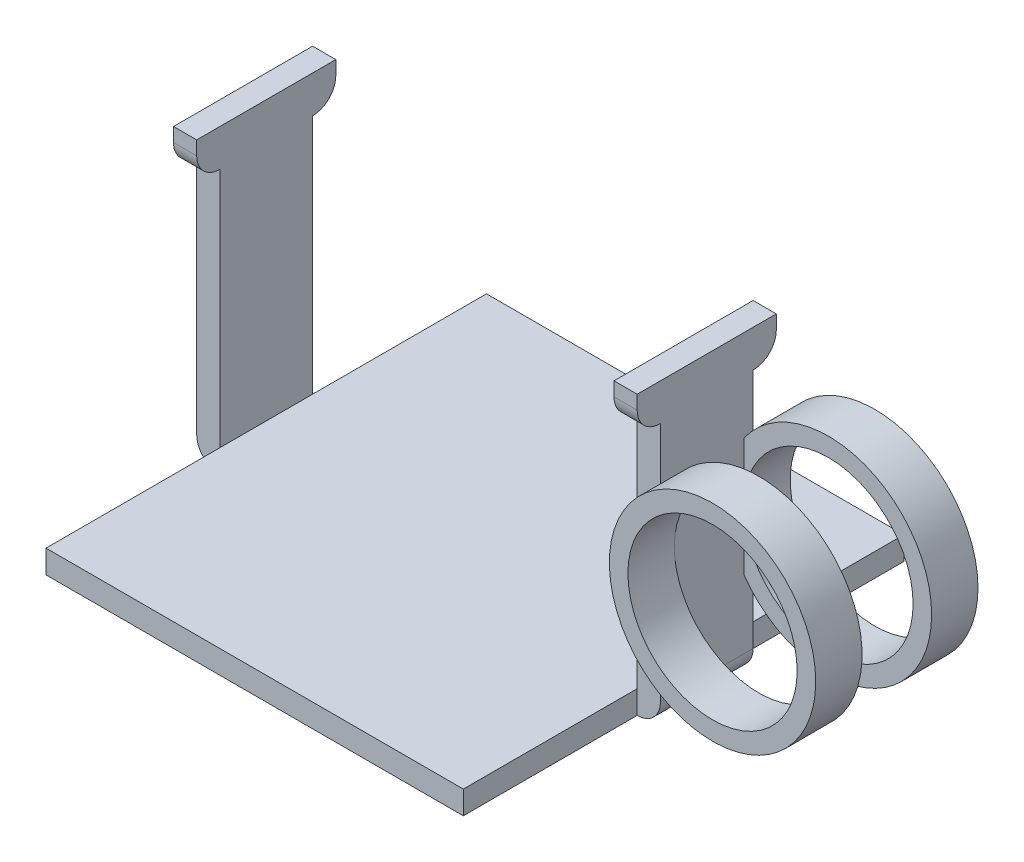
ISO-10303-21;
HEADER;
FILE_DESCRIPTION(('STEP AP214'),'2;1');
FILE_NAME('part.step','',(''),(''),'','','');
FILE_SCHEMA(('AUTOMOTIVE_DESIGN { 1 0 10303 214 1 1 1 1 }'));
ENDSEC;
DATA;
#1=APPLICATION_CONTEXT('core data for automotive mechanical design processes');
#2=APPLICATION_PROTOCOL_DEFINITION('international standard','automotive_design',2000,#1);
#3=PRODUCT_CONTEXT('',#1,'mechanical');
#4=PRODUCT('Part','Part','',(#3));
#5=PRODUCT_RELATED_PRODUCT_CATEGORY('part','',(#4));
#6=PRODUCT_DEFINITION_FORMATION('','',#4);
#7=PRODUCT_DEFINITION_CONTEXT('part definition',#1,'design');
#8=PRODUCT_DEFINITION('design','',#6,#7);
#9=PRODUCT_DEFINITION_SHAPE('','',#8);
#10=(LENGTH_UNIT() NAMED_UNIT(*) SI_UNIT(.MILLI.,.METRE.));
#11=(NAMED_UNIT(*) PLANE_ANGLE_UNIT() SI_UNIT($,.RADIAN.));
#12=(NAMED_UNIT(*) SI_UNIT($,.STERADIAN.) SOLID_ANGLE_UNIT());
#13=UNCERTAINTY_MEASURE_WITH_UNIT(LENGTH_MEASURE(1.E-05),#10,'distance_accuracy_value','');
#14=(GEOMETRIC_REPRESENTATION_CONTEXT(3) GLOBAL_UNCERTAINTY_ASSIGNED_CONTEXT((#13)) GLOBAL_UNIT_ASSIGNED_CONTEXT((#10,
#11,#12)) REPRESENTATION_CONTEXT('',''));
#15=CARTESIAN_POINT('',(0.,0.,0.));
#16=DIRECTION('',(0.,0.,1.));
#17=DIRECTION('',(1.,0.,0.));
#18=AXIS2_PLACEMENT_3D('',#15,#16,#17);
#19=CARTESIAN_POINT('',(50.,57.,0.));
#20=DIRECTION('',(1.,0.,0.));
#21=DIRECTION('',(0.,0.,-1.));
#22=AXIS2_PLACEMENT_3D('',#19,#20,#21);
#23=PLANE('',#22);
#24=DIRECTION('',(0.,0.,1.));
#25=VECTOR('',#24,1.);
#26=CARTESIAN_POINT('',(50.,45.2769235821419,-18.));
#27=LINE('',#26,#25);
#28=CARTESIAN_POINT('',(50.,45.2769235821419,-10.));
#29=VERTEX_POINT('',#28);
#30=CARTESIAN_POINT('',(50.,45.2769235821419,-8.));
#31=VERTEX_POINT('',#30);
#32=EDGE_CURVE('E259',#29,#31,#27,.T.);
#33=ORIENTED_EDGE('',*,*,#32,.F.);
#34=DIRECTION('',(0.,-1.,0.));
#35=VECTOR('',#34,1.);
#36=CARTESIAN_POINT('',(50.,57.,-10.));
#37=LINE('',#36,#35);
#38=CARTESIAN_POINT('',(50.,57.,-10.));
#39=VERTEX_POINT('',#38);
#40=EDGE_CURVE('E386',#39,#29,#37,.T.);
#41=ORIENTED_EDGE('',*,*,#40,.F.);
#42=CARTESIAN_POINT('',(50.,62.,-10.));
#43=DIRECTION('',(1.,0.,0.));
#44=DIRECTION('',(0.,0.,-1.));
#45=AXIS2_PLACEMENT_3D('',#42,#43,#44);
#46=CIRCLE('',#45,5.);
#47=CARTESIAN_POINT('',(50.,62.,-15.));
#48=VERTEX_POINT('',#47);
#49=EDGE_CURVE('E456',#39,#48,#46,.T.);
#50=ORIENTED_EDGE('',*,*,#49,.T.);
#51=DIRECTION('',(0.,-1.,0.));
#52=VECTOR('',#51,1.);
#53=CARTESIAN_POINT('',(50.,65.,-15.));
#54=LINE('',#53,#52);
#55=CARTESIAN_POINT('',(50.,65.,-15.));
#56=VERTEX_POINT('',#55);
#57=EDGE_CURVE('E363',#56,#48,#54,.T.);
#58=ORIENTED_EDGE('',*,*,#57,.F.);
#59=DIRECTION('',(0.,0.,-1.));
#60=VECTOR('',#59,1.);
#61=CARTESIAN_POINT('',(50.,65.,15.));
#62=LINE('',#61,#60);
#63=CARTESIAN_POINT('',(50.,65.,15.));
#64=VERTEX_POINT('',#63);
#65=EDGE_CURVE('E337',#64,#56,#62,.T.);
#66=ORIENTED_EDGE('',*,*,#65,.F.);
#67=DIRECTION('',(0.,-1.,0.));
#68=VECTOR('',#67,1.);
#69=CARTESIAN_POINT('',(50.,65.,15.));
#70=LINE('',#69,#68);
#71=CARTESIAN_POINT('',(50.,62.,15.));
#72=VERTEX_POINT('',#71);
#73=EDGE_CURVE('E351',#64,#72,#70,.T.);
#74=ORIENTED_EDGE('',*,*,#73,.T.);
#75=CARTESIAN_POINT('',(50.,62.,9.99999999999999));
#76=DIRECTION('',(1.,0.,0.));
#77=DIRECTION('',(0.,0.,-1.));
#78=AXIS2_PLACEMENT_3D('',#75,#76,#77);
#79=CIRCLE('',#78,5.);
#80=CARTESIAN_POINT('',(50.,57.,9.99999999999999));
#81=VERTEX_POINT('',#80);
#82=EDGE_CURVE('E459',#72,#81,#79,.T.);
#83=ORIENTED_EDGE('',*,*,#82,.T.);
#84=DIRECTION('',(0.,-1.,0.));
#85=VECTOR('',#84,1.);
#86=CARTESIAN_POINT('',(50.,57.,9.99999999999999));
#87=LINE('',#86,#85);
#88=CARTESIAN_POINT('',(50.,45.2769235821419,9.99999999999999));
#89=VERTEX_POINT('',#88);
#90=EDGE_CURVE('E391',#81,#89,#87,.T.);
#91=ORIENTED_EDGE('',*,*,#90,.T.);
#92=DIRECTION('',(0.,0.,-1.));
#93=VECTOR('',#92,1.);
#94=CARTESIAN_POINT('',(50.,45.2769235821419,17.));
#95=LINE('',#94,#93);
#96=CARTESIAN_POINT('',(50.,45.2769235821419,7.));
#97=VERTEX_POINT('',#96);
#98=EDGE_CURVE('E523',#89,#97,#95,.T.);
#99=ORIENTED_EDGE('',*,*,#98,.T.);
#100=DIRECTION('',(0.,-1.,0.));
#101=VECTOR('',#100,1.);
#102=CARTESIAN_POINT('',(50.,57.,7.));
#103=LINE('',#102,#101);
#104=CARTESIAN_POINT('',(50.,32.549001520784,7.));
#105=VERTEX_POINT('',#104);
#106=EDGE_CURVE('E519',#97,#105,#103,.T.);
#107=ORIENTED_EDGE('',*,*,#106,.T.);
#108=CARTESIAN_POINT('',(50.,19.8210794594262,7.));
#109=VERTEX_POINT('',#108);
#110=EDGE_CURVE('E514',#105,#109,#103,.T.);
#111=ORIENTED_EDGE('',*,*,#110,.T.);
#112=DIRECTION('',(0.,0.,-1.));
#113=VECTOR('',#112,1.);
#114=CARTESIAN_POINT('',(50.,19.8210794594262,17.));
#115=LINE('',#114,#113);
#116=CARTESIAN_POINT('',(50.,19.8210794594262,9.99999999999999));
#117=VERTEX_POINT('',#116);
#118=EDGE_CURVE('E518',#109,#117,#115,.F.);
#119=ORIENTED_EDGE('',*,*,#118,.T.);
#120=CARTESIAN_POINT('',(50.,5.00000000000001,9.99999999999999));
#121=VERTEX_POINT('',#120);
#122=EDGE_CURVE('E390',#117,#121,#87,.T.);
#123=ORIENTED_EDGE('',*,*,#122,.T.);
#124=DIRECTION('',(0.,0.,1.));
#125=VECTOR('',#124,1.);
#126=CARTESIAN_POINT('',(50.,5.,-10.));
#127=LINE('',#126,#125);
#128=CARTESIAN_POINT('',(50.,5.00000000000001,-10.));
#129=VERTEX_POINT('',#128);
#130=EDGE_CURVE('E452',#121,#129,#127,.F.);
#131=ORIENTED_EDGE('',*,*,#130,.T.);
#132=CARTESIAN_POINT('',(50.,19.8210794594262,-10.));
#133=VERTEX_POINT('',#132);
#134=EDGE_CURVE('E384',#133,#129,#37,.T.);
#135=ORIENTED_EDGE('',*,*,#134,.F.);
#136=DIRECTION('',(0.,0.,1.));
#137=VECTOR('',#136,1.);
#138=CARTESIAN_POINT('',(50.,19.8210794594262,-18.));
#139=LINE('',#138,#137);
#140=CARTESIAN_POINT('',(50.,19.8210794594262,-8.));
#141=VERTEX_POINT('',#140);
#142=EDGE_CURVE('E69',#141,#133,#139,.F.);
#143=ORIENTED_EDGE('',*,*,#142,.F.);
#144=DIRECTION('',(0.,-1.,0.));
#145=VECTOR('',#144,1.);
#146=CARTESIAN_POINT('',(50.,57.,-8.));
#147=LINE('',#146,#145);
#148=CARTESIAN_POINT('',(50.,32.549001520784,-8.));
#149=VERTEX_POINT('',#148);
#150=EDGE_CURVE('E57',#149,#141,#147,.T.);
#151=ORIENTED_EDGE('',*,*,#150,.F.);
#152=EDGE_CURVE('E12',#31,#149,#147,.T.);
#153=ORIENTED_EDGE('',*,*,#152,.F.);
#154=EDGE_LOOP('',(#33,#41,#50,#58,#66,#74,#83,#91,#99,#107,#111,#119,#123,#131,#135,#143,#151,#153));
#155=FACE_BOUND('',#154,.T.);
#156=ADVANCED_FACE('F53',(#155),#23,.T.);
#157=CARTESIAN_POINT('',(-45.,5.,0.));
#158=DIRECTION('',(-1.,0.,0.));
#159=DIRECTION('',(0.,0.,1.));
#160=AXIS2_PLACEMENT_3D('',#157,#158,#159);
#161=PLANE('',#160);
#162=DIRECTION('',(0.,0.,-1.));
#163=VECTOR('',#162,1.);
#164=CARTESIAN_POINT('',(-45.,5.,0.));
#165=LINE('',#164,#163);
#166=CARTESIAN_POINT('',(-45.,5.,47.5));
#167=VERTEX_POINT('',#166);
#168=CARTESIAN_POINT('',(-45.,5.00000000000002,9.99999999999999));
#169=VERTEX_POINT('',#168);
#170=EDGE_CURVE('E412',#167,#169,#165,.T.);
#171=ORIENTED_EDGE('',*,*,#170,.T.);
#172=DIRECTION('',(0.,-1.,0.));
#173=VECTOR('',#172,1.);
#174=CARTESIAN_POINT('',(-45.,57.,9.99999999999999));
#175=LINE('',#174,#173);
#176=CARTESIAN_POINT('',(-45.,0.,9.99999999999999));
#177=VERTEX_POINT('',#176);
#178=EDGE_CURVE('E338',#169,#177,#175,.T.);
#179=ORIENTED_EDGE('',*,*,#178,.T.);
#180=DIRECTION('',(0.,0.,-1.));
#181=VECTOR('',#180,1.);
#182=CARTESIAN_POINT('',(-45.,0.,0.));
#183=LINE('',#182,#181);
#184=CARTESIAN_POINT('',(-45.,0.,47.5));
#185=VERTEX_POINT('',#184);
#186=EDGE_CURVE('E401',#185,#177,#183,.T.);
#187=ORIENTED_EDGE('',*,*,#186,.F.);
#188=DIRECTION('',(0.,-1.,0.));
#189=VECTOR('',#188,1.);
#190=CARTESIAN_POINT('',(-45.,5.,47.5));
#191=LINE('',#190,#189);
#192=EDGE_CURVE('E416',#167,#185,#191,.T.);
#193=ORIENTED_EDGE('',*,*,#192,.F.);
#194=EDGE_LOOP('',(#171,#179,#187,#193));
#195=FACE_BOUND('',#194,.T.);
#196=ADVANCED_FACE('F553',(#195),#161,.T.);
#197=CARTESIAN_POINT('',(45.,5.,0.));
#198=DIRECTION('',(-1.,0.,0.));
#199=DIRECTION('',(0.,0.,1.));
#200=AXIS2_PLACEMENT_3D('',#197,#198,#199);
#201=PLANE('',#200);
#202=DIRECTION('',(0.,-1.,0.));
#203=VECTOR('',#202,1.);
#204=CARTESIAN_POINT('',(45.,57.,9.99999999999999));
#205=LINE('',#204,#203);
#206=CARTESIAN_POINT('',(45.,5.00000000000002,9.99999999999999));
#207=VERTEX_POINT('',#206);
#208=CARTESIAN_POINT('',(45.,0.,9.99999999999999));
#209=VERTEX_POINT('',#208);
#210=EDGE_CURVE('E380',#207,#209,#205,.T.);
#211=ORIENTED_EDGE('',*,*,#210,.F.);
#212=DIRECTION('',(0.,0.,-1.));
#213=VECTOR('',#212,1.);
#214=CARTESIAN_POINT('',(45.,5.,0.));
#215=LINE('',#214,#213);
#216=CARTESIAN_POINT('',(45.,5.,47.5));
#217=VERTEX_POINT('',#216);
#218=EDGE_CURVE('E402',#217,#207,#215,.T.);
#219=ORIENTED_EDGE('',*,*,#218,.F.);
#220=DIRECTION('',(0.,-1.,0.));
#221=VECTOR('',#220,1.);
#222=CARTESIAN_POINT('',(45.,5.,47.5));
#223=LINE('',#222,#221);
#224=CARTESIAN_POINT('',(45.,0.,47.5));
#225=VERTEX_POINT('',#224);
#226=EDGE_CURVE('E444',#217,#225,#223,.T.);
#227=ORIENTED_EDGE('',*,*,#226,.T.);
#228=DIRECTION('',(0.,0.,-1.));
#229=VECTOR('',#228,1.);
#230=CARTESIAN_POINT('',(45.,0.,0.));
#231=LINE('',#230,#229);
#232=EDGE_CURVE('E422',#225,#209,#231,.T.);
#233=ORIENTED_EDGE('',*,*,#232,.T.);
#234=EDGE_LOOP('',(#211,#219,#227,#233));
#235=FACE_BOUND('',#234,.T.);
#236=ADVANCED_FACE('F558',(#235),#201,.F.);
#237=CARTESIAN_POINT('',(0.,5.,47.5));
#238=DIRECTION('',(0.,0.,-1.));
#239=DIRECTION('',(-1.,0.,0.));
#240=AXIS2_PLACEMENT_3D('',#237,#238,#239);
#241=PLANE('',#240);
#242=DIRECTION('',(1.,0.,0.));
#243=VECTOR('',#242,1.);
#244=CARTESIAN_POINT('',(0.,0.,47.5));
#245=LINE('',#244,#243);
#246=EDGE_CURVE('E395',#185,#225,#245,.T.);
#247=ORIENTED_EDGE('',*,*,#246,.T.);
#248=ORIENTED_EDGE('',*,*,#226,.F.);
#249=DIRECTION('',(1.,0.,0.));
#250=VECTOR('',#249,1.);
#251=CARTESIAN_POINT('',(0.,5.,47.5));
#252=LINE('',#251,#250);
#253=EDGE_CURVE('E396',#167,#217,#252,.T.);
#254=ORIENTED_EDGE('',*,*,#253,.F.);
#255=ORIENTED_EDGE('',*,*,#192,.T.);
#256=EDGE_LOOP('',(#247,#248,#254,#255));
#257=FACE_BOUND('',#256,.T.);
#258=ADVANCED_FACE('F588',(#257),#241,.F.);
#259=CARTESIAN_POINT('',(45.,5.00000000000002,-10.));
#260=VERTEX_POINT('',#259);
#261=CARTESIAN_POINT('',(45.,5.,-47.5));
#262=VERTEX_POINT('',#261);
#263=EDGE_CURVE('E400',#260,#262,#215,.T.);
#264=ORIENTED_EDGE('',*,*,#263,.F.);
#265=DIRECTION('',(0.,-1.,0.));
#266=VECTOR('',#265,1.);
#267=CARTESIAN_POINT('',(45.,57.,-10.));
#268=LINE('',#267,#266);
#269=CARTESIAN_POINT('',(45.,0.,-10.));
#270=VERTEX_POINT('',#269);
#271=EDGE_CURVE('E385',#260,#270,#268,.T.);
#272=ORIENTED_EDGE('',*,*,#271,.T.);
#273=CARTESIAN_POINT('',(45.,0.,-47.5));
#274=VERTEX_POINT('',#273);
#275=EDGE_CURVE('E421',#270,#274,#231,.T.);
#276=ORIENTED_EDGE('',*,*,#275,.T.);
#277=DIRECTION('',(0.,-1.,0.));
#278=VECTOR('',#277,1.);
#279=CARTESIAN_POINT('',(45.,5.,-47.5));
#280=LINE('',#279,#278);
#281=EDGE_CURVE('E440',#262,#274,#280,.T.);
#282=ORIENTED_EDGE('',*,*,#281,.F.);
#283=EDGE_LOOP('',(#264,#272,#276,#282));
#284=FACE_BOUND('',#283,.T.);
#285=ADVANCED_FACE('F584',(#284),#201,.F.);
#286=CARTESIAN_POINT('',(0.,5.,-47.5));
#287=DIRECTION('',(0.,0.,-1.));
#288=DIRECTION('',(-1.,0.,0.));
#289=AXIS2_PLACEMENT_3D('',#286,#287,#288);
#290=PLANE('',#289);
#291=DIRECTION('',(1.,0.,0.));
#292=VECTOR('',#291,1.);
#293=CARTESIAN_POINT('',(0.,0.,-47.5));
#294=LINE('',#293,#292);
#295=CARTESIAN_POINT('',(-45.,0.,-47.5));
#296=VERTEX_POINT('',#295);
#297=EDGE_CURVE('E426',#296,#274,#294,.T.);
#298=ORIENTED_EDGE('',*,*,#297,.F.);
#299=DIRECTION('',(0.,-1.,0.));
#300=VECTOR('',#299,1.);
#301=CARTESIAN_POINT('',(-45.,5.,-47.5));
#302=LINE('',#301,#300);
#303=CARTESIAN_POINT('',(-45.,5.,-47.5));
#304=VERTEX_POINT('',#303);
#305=EDGE_CURVE('E436',#304,#296,#302,.T.);
#306=ORIENTED_EDGE('',*,*,#305,.F.);
#307=DIRECTION('',(1.,0.,0.));
#308=VECTOR('',#307,1.);
#309=CARTESIAN_POINT('',(0.,5.,-47.5));
#310=LINE('',#309,#308);
#311=EDGE_CURVE('E406',#304,#262,#310,.T.);
#312=ORIENTED_EDGE('',*,*,#311,.T.);
#313=ORIENTED_EDGE('',*,*,#281,.T.);
#314=EDGE_LOOP('',(#298,#306,#312,#313));
#315=FACE_BOUND('',#314,.T.);
#316=ADVANCED_FACE('F580',(#315),#290,.T.);
#317=DIRECTION('',(0.,-1.,0.));
#318=VECTOR('',#317,1.);
#319=CARTESIAN_POINT('',(-45.,57.,-10.));
#320=LINE('',#319,#318);
#321=CARTESIAN_POINT('',(-45.,5.00000000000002,-10.));
#322=VERTEX_POINT('',#321);
#323=CARTESIAN_POINT('',(-45.,0.,-10.));
#324=VERTEX_POINT('',#323);
#325=EDGE_CURVE('E333',#322,#324,#320,.T.);
#326=ORIENTED_EDGE('',*,*,#325,.F.);
#327=EDGE_CURVE('E411',#322,#304,#165,.T.);
#328=ORIENTED_EDGE('',*,*,#327,.T.);
#329=ORIENTED_EDGE('',*,*,#305,.T.);
#330=EDGE_CURVE('E430',#324,#296,#183,.T.);
#331=ORIENTED_EDGE('',*,*,#330,.F.);
#332=EDGE_LOOP('',(#326,#328,#329,#331));
#333=FACE_BOUND('',#332,.T.);
#334=ADVANCED_FACE('F561',(#333),#161,.T.);
#335=CARTESIAN_POINT('',(0.,5.,0.));
#336=DIRECTION('',(0.,1.,0.));
#337=DIRECTION('',(0.,0.,1.));
#338=AXIS2_PLACEMENT_3D('',#335,#336,#337);
#339=PLANE('',#338);
#340=ORIENTED_EDGE('',*,*,#253,.T.);
#341=ORIENTED_EDGE('',*,*,#218,.T.);
#342=EDGE_CURVE('E407',#207,#260,#215,.T.);
#343=ORIENTED_EDGE('',*,*,#342,.T.);
#344=ORIENTED_EDGE('',*,*,#263,.T.);
#345=ORIENTED_EDGE('',*,*,#311,.F.);
#346=ORIENTED_EDGE('',*,*,#327,.F.);
#347=EDGE_CURVE('E417',#169,#322,#165,.T.);
#348=ORIENTED_EDGE('',*,*,#347,.F.);
#349=ORIENTED_EDGE('',*,*,#170,.F.);
#350=EDGE_LOOP('',(#340,#341,#343,#344,#345,#346,#348,#349));
#351=FACE_BOUND('',#350,.T.);
#352=ADVANCED_FACE('F571',(#351),#339,.T.);
#353=CARTESIAN_POINT('',(0.,0.,0.));
#354=DIRECTION('',(0.,1.,0.));
#355=DIRECTION('',(0.,0.,1.));
#356=AXIS2_PLACEMENT_3D('',#353,#354,#355);
#357=PLANE('',#356);
#358=ORIENTED_EDGE('',*,*,#186,.T.);
#359=DIRECTION('',(0.,0.,1.));
#360=VECTOR('',#359,1.);
#361=CARTESIAN_POINT('',(-45.,0.,0.));
#362=LINE('',#361,#360);
#363=EDGE_CURVE('E508',#177,#324,#362,.F.);
#364=ORIENTED_EDGE('',*,*,#363,.T.);
#365=ORIENTED_EDGE('',*,*,#330,.T.);
#366=ORIENTED_EDGE('',*,*,#297,.T.);
#367=ORIENTED_EDGE('',*,*,#275,.F.);
#368=DIRECTION('',(0.,0.,1.));
#369=VECTOR('',#368,1.);
#370=CARTESIAN_POINT('',(45.,0.,9.99999999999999));
#371=LINE('',#370,#369);
#372=EDGE_CURVE('E472',#270,#209,#371,.T.);
#373=ORIENTED_EDGE('',*,*,#372,.T.);
#374=ORIENTED_EDGE('',*,*,#232,.F.);
#375=ORIENTED_EDGE('',*,*,#246,.F.);
#376=EDGE_LOOP('',(#358,#364,#365,#366,#367,#373,#374,#375));
#377=FACE_BOUND('',#376,.T.);
#378=ADVANCED_FACE('F574',(#377),#357,.F.);
#379=CARTESIAN_POINT('',(45.,57.,0.));
#380=DIRECTION('',(-1.,0.,0.));
#381=DIRECTION('',(0.,0.,1.));
#382=AXIS2_PLACEMENT_3D('',#379,#380,#381);
#383=PLANE('',#382);
#384=CARTESIAN_POINT('',(45.,57.,9.99999999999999));
#385=VERTEX_POINT('',#384);
#386=EDGE_CURVE('E375',#385,#207,#205,.T.);
#387=ORIENTED_EDGE('',*,*,#386,.F.);
#388=CARTESIAN_POINT('',(45.,62.,9.99999999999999));
#389=DIRECTION('',(-1.,0.,0.));
#390=DIRECTION('',(0.,0.,1.));
#391=AXIS2_PLACEMENT_3D('',#388,#389,#390);
#392=CIRCLE('',#391,5.);
#393=CARTESIAN_POINT('',(45.,62.,15.));
#394=VERTEX_POINT('',#393);
#395=EDGE_CURVE('E465',#385,#394,#392,.T.);
#396=ORIENTED_EDGE('',*,*,#395,.T.);
#397=DIRECTION('',(0.,-1.,0.));
#398=VECTOR('',#397,1.);
#399=CARTESIAN_POINT('',(45.,65.,15.));
#400=LINE('',#399,#398);
#401=CARTESIAN_POINT('',(45.,65.,15.));
#402=VERTEX_POINT('',#401);
#403=EDGE_CURVE('E355',#402,#394,#400,.T.);
#404=ORIENTED_EDGE('',*,*,#403,.F.);
#405=DIRECTION('',(0.,0.,1.));
#406=VECTOR('',#405,1.);
#407=CARTESIAN_POINT('',(45.,65.,15.));
#408=LINE('',#407,#406);
#409=CARTESIAN_POINT('',(45.,65.,-15.));
#410=VERTEX_POINT('',#409);
#411=EDGE_CURVE('E345',#410,#402,#408,.T.);
#412=ORIENTED_EDGE('',*,*,#411,.F.);
#413=DIRECTION('',(0.,-1.,0.));
#414=VECTOR('',#413,1.);
#415=CARTESIAN_POINT('',(45.,65.,-15.));
#416=LINE('',#415,#414);
#417=CARTESIAN_POINT('',(45.,62.,-15.));
#418=VERTEX_POINT('',#417);
#419=EDGE_CURVE('E359',#410,#418,#416,.T.);
#420=ORIENTED_EDGE('',*,*,#419,.T.);
#421=CARTESIAN_POINT('',(45.,62.,-10.));
#422=DIRECTION('',(-1.,0.,0.));
#423=DIRECTION('',(0.,0.,1.));
#424=AXIS2_PLACEMENT_3D('',#421,#422,#423);
#425=CIRCLE('',#424,5.);
#426=CARTESIAN_POINT('',(45.,57.,-10.));
#427=VERTEX_POINT('',#426);
#428=EDGE_CURVE('E462',#418,#427,#425,.T.);
#429=ORIENTED_EDGE('',*,*,#428,.T.);
#430=EDGE_CURVE('E379',#427,#260,#268,.T.);
#431=ORIENTED_EDGE('',*,*,#430,.T.);
#432=ORIENTED_EDGE('',*,*,#342,.F.);
#433=EDGE_LOOP('',(#387,#396,#404,#412,#420,#429,#431,#432));
#434=FACE_BOUND('',#433,.T.);
#435=ADVANCED_FACE('F569',(#434),#383,.T.);
#436=CARTESIAN_POINT('',(0.,57.,10.));
#437=DIRECTION('',(0.,0.,1.));
#438=DIRECTION('',(1.,0.,0.));
#439=AXIS2_PLACEMENT_3D('',#436,#437,#438);
#440=PLANE('',#439);
#441=ORIENTED_EDGE('',*,*,#122,.F.);
#442=CARTESIAN_POINT('',(68.25,32.549001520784,9.99999999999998));
#443=DIRECTION('',(0.,0.,1.));
#444=DIRECTION('',(1.,0.,0.));
#445=AXIS2_PLACEMENT_3D('',#442,#443,#444);
#446=CIRCLE('',#445,22.25);
#447=EDGE_CURVE('E274',#117,#89,#446,.F.);
#448=ORIENTED_EDGE('',*,*,#447,.T.);
#449=ORIENTED_EDGE('',*,*,#90,.F.);
#450=DIRECTION('',(-1.,0.,0.));
#451=VECTOR('',#450,1.);
#452=CARTESIAN_POINT('',(0.,57.,10.));
#453=LINE('',#452,#451);
#454=EDGE_CURVE('E367',#81,#385,#453,.T.);
#455=ORIENTED_EDGE('',*,*,#454,.T.);
#456=ORIENTED_EDGE('',*,*,#386,.T.);
#457=ORIENTED_EDGE('',*,*,#210,.T.);
#458=CARTESIAN_POINT('',(45.,5.,9.99999999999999));
#459=DIRECTION('',(0.,0.,1.));
#460=DIRECTION('',(1.,0.,0.));
#461=AXIS2_PLACEMENT_3D('',#458,#459,#460);
#462=CIRCLE('',#461,5.);
#463=EDGE_CURVE('E476',#209,#121,#462,.T.);
#464=ORIENTED_EDGE('',*,*,#463,.T.);
#465=EDGE_LOOP('',(#441,#448,#449,#455,#456,#457,#464));
#466=FACE_BOUND('',#465,.T.);
#467=ADVANCED_FACE('F566',(#466),#440,.T.);
#468=CARTESIAN_POINT('',(0.,57.,-9.99999999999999));
#469=DIRECTION('',(0.,0.,1.));
#470=DIRECTION('',(1.,0.,0.));
#471=AXIS2_PLACEMENT_3D('',#468,#469,#470);
#472=PLANE('',#471);
#473=ORIENTED_EDGE('',*,*,#40,.T.);
#474=CARTESIAN_POINT('',(68.25,32.549001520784,-10.));
#475=DIRECTION('',(0.,0.,1.));
#476=DIRECTION('',(1.,0.,0.));
#477=AXIS2_PLACEMENT_3D('',#474,#475,#476);
#478=CIRCLE('',#477,22.25);
#479=EDGE_CURVE('E526',#29,#133,#478,.T.);
#480=ORIENTED_EDGE('',*,*,#479,.T.);
#481=ORIENTED_EDGE('',*,*,#134,.T.);
#482=CARTESIAN_POINT('',(45.,5.,-10.));
#483=DIRECTION('',(0.,0.,1.));
#484=DIRECTION('',(1.,0.,0.));
#485=AXIS2_PLACEMENT_3D('',#482,#483,#484);
#486=CIRCLE('',#485,5.);
#487=EDGE_CURVE('E480',#129,#270,#486,.F.);
#488=ORIENTED_EDGE('',*,*,#487,.T.);
#489=ORIENTED_EDGE('',*,*,#271,.F.);
#490=ORIENTED_EDGE('',*,*,#430,.F.);
#491=DIRECTION('',(-1.,0.,0.));
#492=VECTOR('',#491,1.);
#493=CARTESIAN_POINT('',(0.,57.,-9.99999999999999));
#494=LINE('',#493,#492);
#495=EDGE_CURVE('E371',#39,#427,#494,.T.);
#496=ORIENTED_EDGE('',*,*,#495,.F.);
#497=EDGE_LOOP('',(#473,#480,#481,#488,#489,#490,#496));
#498=FACE_BOUND('',#497,.T.);
#499=ADVANCED_FACE('F564',(#498),#472,.F.);
#500=CARTESIAN_POINT('',(45.,65.,-15.));
#501=DIRECTION('',(0.,0.,1.));
#502=DIRECTION('',(1.,0.,0.));
#503=AXIS2_PLACEMENT_3D('',#500,#501,#502);
#504=PLANE('',#503);
#505=ORIENTED_EDGE('',*,*,#57,.T.);
#506=DIRECTION('',(-1.,0.,0.));
#507=VECTOR('',#506,1.);
#508=CARTESIAN_POINT('',(45.,62.,-15.));
#509=LINE('',#508,#507);
#510=EDGE_CURVE('E468',#48,#418,#509,.T.);
#511=ORIENTED_EDGE('',*,*,#510,.T.);
#512=ORIENTED_EDGE('',*,*,#419,.F.);
#513=DIRECTION('',(-1.,0.,0.));
#514=VECTOR('',#513,1.);
#515=CARTESIAN_POINT('',(45.,65.,-15.));
#516=LINE('',#515,#514);
#517=EDGE_CURVE('E342',#56,#410,#516,.T.);
#518=ORIENTED_EDGE('',*,*,#517,.F.);
#519=EDGE_LOOP('',(#505,#511,#512,#518));
#520=FACE_BOUND('',#519,.T.);
#521=ADVANCED_FACE('F675',(#520),#504,.F.);
#522=CARTESIAN_POINT('',(45.,65.,15.));
#523=DIRECTION('',(0.,0.,-1.));
#524=DIRECTION('',(-1.,0.,0.));
#525=AXIS2_PLACEMENT_3D('',#522,#523,#524);
#526=PLANE('',#525);
#527=ORIENTED_EDGE('',*,*,#403,.T.);
#528=DIRECTION('',(1.,0.,0.));
#529=VECTOR('',#528,1.);
#530=CARTESIAN_POINT('',(50.,62.,15.));
#531=LINE('',#530,#529);
#532=EDGE_CURVE('E448',#394,#72,#531,.T.);
#533=ORIENTED_EDGE('',*,*,#532,.T.);
#534=ORIENTED_EDGE('',*,*,#73,.F.);
#535=DIRECTION('',(1.,0.,0.));
#536=VECTOR('',#535,1.);
#537=CARTESIAN_POINT('',(45.,65.,15.));
#538=LINE('',#537,#536);
#539=EDGE_CURVE('E348',#402,#64,#538,.T.);
#540=ORIENTED_EDGE('',*,*,#539,.F.);
#541=EDGE_LOOP('',(#527,#533,#534,#540));
#542=FACE_BOUND('',#541,.T.);
#543=ADVANCED_FACE('F671',(#542),#526,.F.);
#544=CARTESIAN_POINT('',(0.,65.,0.));
#545=DIRECTION('',(0.,-1.,0.));
#546=DIRECTION('',(0.,0.,-1.));
#547=AXIS2_PLACEMENT_3D('',#544,#545,#546);
#548=PLANE('',#547);
#549=ORIENTED_EDGE('',*,*,#65,.T.);
#550=ORIENTED_EDGE('',*,*,#517,.T.);
#551=ORIENTED_EDGE('',*,*,#411,.T.);
#552=ORIENTED_EDGE('',*,*,#539,.T.);
#553=EDGE_LOOP('',(#549,#550,#551,#552));
#554=FACE_BOUND('',#553,.T.);
#555=ADVANCED_FACE('F597',(#554),#548,.F.);
#556=CARTESIAN_POINT('',(45.,62.,9.99999999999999));
#557=DIRECTION('',(-1.,0.,0.));
#558=DIRECTION('',(0.,0.,1.));
#559=AXIS2_PLACEMENT_3D('',#556,#557,#558);
#560=CYLINDRICAL_SURFACE('',#559,5.);
#561=ORIENTED_EDGE('',*,*,#395,.F.);
#562=ORIENTED_EDGE('',*,*,#454,.F.);
#563=ORIENTED_EDGE('',*,*,#82,.F.);
#564=ORIENTED_EDGE('',*,*,#532,.F.);
#565=EDGE_LOOP('',(#561,#562,#563,#564));
#566=FACE_BOUND('',#565,.T.);
#567=ADVANCED_FACE('F593',(#566),#560,.T.);
#568=CARTESIAN_POINT('',(45.,62.,-10.));
#569=DIRECTION('',(1.,0.,0.));
#570=DIRECTION('',(0.,0.,-1.));
#571=AXIS2_PLACEMENT_3D('',#568,#569,#570);
#572=CYLINDRICAL_SURFACE('',#571,5.);
#573=ORIENTED_EDGE('',*,*,#49,.F.);
#574=ORIENTED_EDGE('',*,*,#495,.T.);
#575=ORIENTED_EDGE('',*,*,#428,.F.);
#576=ORIENTED_EDGE('',*,*,#510,.F.);
#577=EDGE_LOOP('',(#573,#574,#575,#576));
#578=FACE_BOUND('',#577,.T.);
#579=ADVANCED_FACE('F596',(#578),#572,.T.);
#580=CARTESIAN_POINT('',(45.,5.,0.));
#581=DIRECTION('',(0.,0.,-1.));
#582=DIRECTION('',(-1.,0.,0.));
#583=AXIS2_PLACEMENT_3D('',#580,#581,#582);
#584=CYLINDRICAL_SURFACE('',#583,5.);
#585=ORIENTED_EDGE('',*,*,#487,.F.);
#586=ORIENTED_EDGE('',*,*,#130,.F.);
#587=ORIENTED_EDGE('',*,*,#463,.F.);
#588=ORIENTED_EDGE('',*,*,#372,.F.);
#589=EDGE_LOOP('',(#585,#586,#587,#588));
#590=FACE_BOUND('',#589,.T.);
#591=ADVANCED_FACE('F601',(#590),#584,.T.);
#592=CARTESIAN_POINT('',(-45.,57.,0.));
#593=DIRECTION('',(-1.,0.,0.));
#594=DIRECTION('',(0.,0.,1.));
#595=AXIS2_PLACEMENT_3D('',#592,#593,#594);
#596=PLANE('',#595);
#597=DIRECTION('',(0.,-1.,0.));
#598=VECTOR('',#597,1.);
#599=CARTESIAN_POINT('',(-45.,65.,15.));
#600=LINE('',#599,#598);
#601=CARTESIAN_POINT('',(-45.,65.,15.));
#602=VERTEX_POINT('',#601);
#603=CARTESIAN_POINT('',(-45.,62.,15.));
#604=VERTEX_POINT('',#603);
#605=EDGE_CURVE('E304',#602,#604,#600,.T.);
#606=ORIENTED_EDGE('',*,*,#605,.T.);
#607=CARTESIAN_POINT('',(-45.,62.,9.99999999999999));
#608=DIRECTION('',(-1.,0.,0.));
#609=DIRECTION('',(0.,0.,1.));
#610=AXIS2_PLACEMENT_3D('',#607,#608,#609);
#611=CIRCLE('',#610,5.);
#612=CARTESIAN_POINT('',(-45.,57.,9.99999999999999));
#613=VERTEX_POINT('',#612);
#614=EDGE_CURVE('E499',#604,#613,#611,.F.);
#615=ORIENTED_EDGE('',*,*,#614,.T.);
#616=EDGE_CURVE('E332',#613,#169,#175,.T.);
#617=ORIENTED_EDGE('',*,*,#616,.T.);
#618=ORIENTED_EDGE('',*,*,#347,.T.);
#619=CARTESIAN_POINT('',(-45.,57.,-10.));
#620=VERTEX_POINT('',#619);
#621=EDGE_CURVE('E328',#620,#322,#320,.T.);
#622=ORIENTED_EDGE('',*,*,#621,.F.);
#623=CARTESIAN_POINT('',(-45.,62.,-10.));
#624=DIRECTION('',(-1.,0.,0.));
#625=DIRECTION('',(0.,0.,1.));
#626=AXIS2_PLACEMENT_3D('',#623,#624,#625);
#627=CIRCLE('',#626,5.);
#628=CARTESIAN_POINT('',(-45.,62.,-15.));
#629=VERTEX_POINT('',#628);
#630=EDGE_CURVE('E496',#620,#629,#627,.F.);
#631=ORIENTED_EDGE('',*,*,#630,.T.);
#632=DIRECTION('',(0.,-1.,0.));
#633=VECTOR('',#632,1.);
#634=CARTESIAN_POINT('',(-45.,65.,-15.));
#635=LINE('',#634,#633);
#636=CARTESIAN_POINT('',(-45.,65.,-15.));
#637=VERTEX_POINT('',#636);
#638=EDGE_CURVE('E300',#637,#629,#635,.T.);
#639=ORIENTED_EDGE('',*,*,#638,.F.);
#640=DIRECTION('',(0.,0.,1.));
#641=VECTOR('',#640,1.);
#642=CARTESIAN_POINT('',(-45.,65.,15.));
#643=LINE('',#642,#641);
#644=EDGE_CURVE('E288',#637,#602,#643,.T.);
#645=ORIENTED_EDGE('',*,*,#644,.T.);
#646=EDGE_LOOP('',(#606,#615,#617,#618,#622,#631,#639,#645));
#647=FACE_BOUND('',#646,.T.);
#648=ADVANCED_FACE('F605',(#647),#596,.F.);
#649=CARTESIAN_POINT('',(0.,57.,10.));
#650=DIRECTION('',(0.,0.,-1.));
#651=DIRECTION('',(-1.,0.,0.));
#652=AXIS2_PLACEMENT_3D('',#649,#650,#651);
#653=PLANE('',#652);
#654=DIRECTION('',(0.,-1.,0.));
#655=VECTOR('',#654,1.);
#656=CARTESIAN_POINT('',(-50.,57.,9.99999999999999));
#657=LINE('',#656,#655);
#658=CARTESIAN_POINT('',(-50.,57.,9.99999999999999));
#659=VERTEX_POINT('',#658);
#660=CARTESIAN_POINT('',(-50.,5.00000000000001,9.99999999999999));
#661=VERTEX_POINT('',#660);
#662=EDGE_CURVE('E320',#659,#661,#657,.T.);
#663=ORIENTED_EDGE('',*,*,#662,.T.);
#664=CARTESIAN_POINT('',(-45.,5.,9.99999999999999));
#665=DIRECTION('',(0.,0.,-1.));
#666=DIRECTION('',(-1.,0.,0.));
#667=AXIS2_PLACEMENT_3D('',#664,#665,#666);
#668=CIRCLE('',#667,5.);
#669=EDGE_CURVE('E505',#661,#177,#668,.F.);
#670=ORIENTED_EDGE('',*,*,#669,.T.);
#671=ORIENTED_EDGE('',*,*,#178,.F.);
#672=ORIENTED_EDGE('',*,*,#616,.F.);
#673=DIRECTION('',(1.,0.,0.));
#674=VECTOR('',#673,1.);
#675=CARTESIAN_POINT('',(0.,57.,10.));
#676=LINE('',#675,#674);
#677=EDGE_CURVE('E312',#659,#613,#676,.T.);
#678=ORIENTED_EDGE('',*,*,#677,.F.);
#679=EDGE_LOOP('',(#663,#670,#671,#672,#678));
#680=FACE_BOUND('',#679,.T.);
#681=ADVANCED_FACE('F636',(#680),#653,.F.);
#682=CARTESIAN_POINT('',(0.,57.,-9.99999999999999));
#683=DIRECTION('',(0.,0.,-1.));
#684=DIRECTION('',(-1.,0.,0.));
#685=AXIS2_PLACEMENT_3D('',#682,#683,#684);
#686=PLANE('',#685);
#687=ORIENTED_EDGE('',*,*,#325,.T.);
#688=CARTESIAN_POINT('',(-45.,5.,-10.));
#689=DIRECTION('',(0.,0.,-1.));
#690=DIRECTION('',(-1.,0.,0.));
#691=AXIS2_PLACEMENT_3D('',#688,#689,#690);
#692=CIRCLE('',#691,5.);
#693=CARTESIAN_POINT('',(-50.,5.00000000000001,-10.));
#694=VERTEX_POINT('',#693);
#695=EDGE_CURVE('E511',#324,#694,#692,.T.);
#696=ORIENTED_EDGE('',*,*,#695,.T.);
#697=DIRECTION('',(0.,-1.,0.));
#698=VECTOR('',#697,1.);
#699=CARTESIAN_POINT('',(-50.,57.,-10.));
#700=LINE('',#699,#698);
#701=CARTESIAN_POINT('',(-50.,57.,-10.));
#702=VERTEX_POINT('',#701);
#703=EDGE_CURVE('E324',#702,#694,#700,.T.);
#704=ORIENTED_EDGE('',*,*,#703,.F.);
#705=DIRECTION('',(1.,0.,0.));
#706=VECTOR('',#705,1.);
#707=CARTESIAN_POINT('',(0.,57.,-9.99999999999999));
#708=LINE('',#707,#706);
#709=EDGE_CURVE('E316',#702,#620,#708,.T.);
#710=ORIENTED_EDGE('',*,*,#709,.T.);
#711=ORIENTED_EDGE('',*,*,#621,.T.);
#712=EDGE_LOOP('',(#687,#696,#704,#710,#711));
#713=FACE_BOUND('',#712,.T.);
#714=ADVANCED_FACE('F629',(#713),#686,.T.);
#715=CARTESIAN_POINT('',(-50.,57.,0.));
#716=DIRECTION('',(1.,0.,0.));
#717=DIRECTION('',(0.,0.,-1.));
#718=AXIS2_PLACEMENT_3D('',#715,#716,#717);
#719=PLANE('',#718);
#720=ORIENTED_EDGE('',*,*,#662,.F.);
#721=CARTESIAN_POINT('',(-50.,62.,9.99999999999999));
#722=DIRECTION('',(1.,0.,0.));
#723=DIRECTION('',(0.,0.,-1.));
#724=AXIS2_PLACEMENT_3D('',#721,#722,#723);
#725=CIRCLE('',#724,5.);
#726=CARTESIAN_POINT('',(-50.,62.,15.));
#727=VERTEX_POINT('',#726);
#728=EDGE_CURVE('E490',#659,#727,#725,.F.);
#729=ORIENTED_EDGE('',*,*,#728,.T.);
#730=DIRECTION('',(0.,-1.,0.));
#731=VECTOR('',#730,1.);
#732=CARTESIAN_POINT('',(-50.,65.,15.));
#733=LINE('',#732,#731);
#734=CARTESIAN_POINT('',(-50.,65.,15.));
#735=VERTEX_POINT('',#734);
#736=EDGE_CURVE('E308',#735,#727,#733,.T.);
#737=ORIENTED_EDGE('',*,*,#736,.F.);
#738=DIRECTION('',(0.,0.,-1.));
#739=VECTOR('',#738,1.);
#740=CARTESIAN_POINT('',(-50.,65.,15.));
#741=LINE('',#740,#739);
#742=CARTESIAN_POINT('',(-50.,65.,-15.));
#743=VERTEX_POINT('',#742);
#744=EDGE_CURVE('E280',#735,#743,#741,.T.);
#745=ORIENTED_EDGE('',*,*,#744,.T.);
#746=DIRECTION('',(0.,-1.,0.));
#747=VECTOR('',#746,1.);
#748=CARTESIAN_POINT('',(-50.,65.,-15.));
#749=LINE('',#748,#747);
#750=CARTESIAN_POINT('',(-50.,62.,-15.));
#751=VERTEX_POINT('',#750);
#752=EDGE_CURVE('E296',#743,#751,#749,.T.);
#753=ORIENTED_EDGE('',*,*,#752,.T.);
#754=CARTESIAN_POINT('',(-50.,62.,-10.));
#755=DIRECTION('',(1.,0.,0.));
#756=DIRECTION('',(0.,0.,-1.));
#757=AXIS2_PLACEMENT_3D('',#754,#755,#756);
#758=CIRCLE('',#757,5.);
#759=EDGE_CURVE('E487',#751,#702,#758,.F.);
#760=ORIENTED_EDGE('',*,*,#759,.T.);
#761=ORIENTED_EDGE('',*,*,#703,.T.);
#762=DIRECTION('',(0.,0.,1.));
#763=VECTOR('',#762,1.);
#764=CARTESIAN_POINT('',(-50.,5.,0.));
#765=LINE('',#764,#763);
#766=EDGE_CURVE('E483',#694,#661,#765,.T.);
#767=ORIENTED_EDGE('',*,*,#766,.T.);
#768=EDGE_LOOP('',(#720,#729,#737,#745,#753,#760,#761,#767));
#769=FACE_BOUND('',#768,.T.);
#770=ADVANCED_FACE('F625',(#769),#719,.F.);
#771=CARTESIAN_POINT('',(-45.,65.,15.));
#772=DIRECTION('',(0.,0.,1.));
#773=DIRECTION('',(1.,0.,0.));
#774=AXIS2_PLACEMENT_3D('',#771,#772,#773);
#775=PLANE('',#774);
#776=ORIENTED_EDGE('',*,*,#736,.T.);
#777=DIRECTION('',(-1.,0.,0.));
#778=VECTOR('',#777,1.);
#779=CARTESIAN_POINT('',(-45.,62.,15.));
#780=LINE('',#779,#778);
#781=EDGE_CURVE('E493',#727,#604,#780,.F.);
#782=ORIENTED_EDGE('',*,*,#781,.T.);
#783=ORIENTED_EDGE('',*,*,#605,.F.);
#784=DIRECTION('',(-1.,0.,0.));
#785=VECTOR('',#784,1.);
#786=CARTESIAN_POINT('',(-45.,65.,15.));
#787=LINE('',#786,#785);
#788=EDGE_CURVE('E284',#602,#735,#787,.T.);
#789=ORIENTED_EDGE('',*,*,#788,.T.);
#790=EDGE_LOOP('',(#776,#782,#783,#789));
#791=FACE_BOUND('',#790,.T.);
#792=ADVANCED_FACE('F643',(#791),#775,.T.);
#793=CARTESIAN_POINT('',(-45.,65.,-15.));
#794=DIRECTION('',(0.,0.,-1.));
#795=DIRECTION('',(-1.,0.,0.));
#796=AXIS2_PLACEMENT_3D('',#793,#794,#795);
#797=PLANE('',#796);
#798=ORIENTED_EDGE('',*,*,#638,.T.);
#799=DIRECTION('',(1.,0.,0.));
#800=VECTOR('',#799,1.);
#801=CARTESIAN_POINT('',(-45.,62.,-15.));
#802=LINE('',#801,#800);
#803=EDGE_CURVE('E502',#629,#751,#802,.F.);
#804=ORIENTED_EDGE('',*,*,#803,.T.);
#805=ORIENTED_EDGE('',*,*,#752,.F.);
#806=DIRECTION('',(1.,0.,0.));
#807=VECTOR('',#806,1.);
#808=CARTESIAN_POINT('',(-45.,65.,-15.));
#809=LINE('',#808,#807);
#810=EDGE_CURVE('E292',#743,#637,#809,.T.);
#811=ORIENTED_EDGE('',*,*,#810,.T.);
#812=EDGE_LOOP('',(#798,#804,#805,#811));
#813=FACE_BOUND('',#812,.T.);
#814=ADVANCED_FACE('F651',(#813),#797,.T.);
#815=CARTESIAN_POINT('',(0.,65.,0.));
#816=DIRECTION('',(0.,-1.,0.));
#817=DIRECTION('',(0.,0.,-1.));
#818=AXIS2_PLACEMENT_3D('',#815,#816,#817);
#819=PLANE('',#818);
#820=ORIENTED_EDGE('',*,*,#744,.F.);
#821=ORIENTED_EDGE('',*,*,#788,.F.);
#822=ORIENTED_EDGE('',*,*,#644,.F.);
#823=ORIENTED_EDGE('',*,*,#810,.F.);
#824=EDGE_LOOP('',(#820,#821,#822,#823));
#825=FACE_BOUND('',#824,.T.);
#826=ADVANCED_FACE('F610',(#825),#819,.F.);
#827=CARTESIAN_POINT('',(0.,62.,9.99999999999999));
#828=DIRECTION('',(-1.,0.,0.));
#829=DIRECTION('',(0.,0.,1.));
#830=AXIS2_PLACEMENT_3D('',#827,#828,#829);
#831=CYLINDRICAL_SURFACE('',#830,5.);
#832=ORIENTED_EDGE('',*,*,#614,.F.);
#833=ORIENTED_EDGE('',*,*,#781,.F.);
#834=ORIENTED_EDGE('',*,*,#728,.F.);
#835=ORIENTED_EDGE('',*,*,#677,.T.);
#836=EDGE_LOOP('',(#832,#833,#834,#835));
#837=FACE_BOUND('',#836,.T.);
#838=ADVANCED_FACE('F607',(#837),#831,.T.);
#839=CARTESIAN_POINT('',(0.,62.,-10.));
#840=DIRECTION('',(1.,0.,0.));
#841=DIRECTION('',(0.,0.,-1.));
#842=AXIS2_PLACEMENT_3D('',#839,#840,#841);
#843=CYLINDRICAL_SURFACE('',#842,5.);
#844=ORIENTED_EDGE('',*,*,#759,.F.);
#845=ORIENTED_EDGE('',*,*,#803,.F.);
#846=ORIENTED_EDGE('',*,*,#630,.F.);
#847=ORIENTED_EDGE('',*,*,#709,.F.);
#848=EDGE_LOOP('',(#844,#845,#846,#847));
#849=FACE_BOUND('',#848,.T.);
#850=ADVANCED_FACE('F609',(#849),#843,.T.);
#851=CARTESIAN_POINT('',(-45.,5.,0.));
#852=DIRECTION('',(0.,0.,1.));
#853=DIRECTION('',(1.,0.,0.));
#854=AXIS2_PLACEMENT_3D('',#851,#852,#853);
#855=CYLINDRICAL_SURFACE('',#854,5.);
#856=ORIENTED_EDGE('',*,*,#695,.F.);
#857=ORIENTED_EDGE('',*,*,#363,.F.);
#858=ORIENTED_EDGE('',*,*,#669,.F.);
#859=ORIENTED_EDGE('',*,*,#766,.F.);
#860=EDGE_LOOP('',(#856,#857,#858,#859));
#861=FACE_BOUND('',#860,.T.);
#862=ADVANCED_FACE('F55',(#861),#855,.T.);
#863=CARTESIAN_POINT('',(68.25,32.549001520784,17.));
#864=DIRECTION('',(0.,0.,1.));
#865=DIRECTION('',(1.,0.,0.));
#866=AXIS2_PLACEMENT_3D('',#863,#864,#865);
#867=PLANE('',#866);
#868=CARTESIAN_POINT('',(68.25,32.549001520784,17.));
#869=DIRECTION('',(0.,0.,1.));
#870=DIRECTION('',(1.,0.,0.));
#871=AXIS2_PLACEMENT_3D('',#868,#869,#870);
#872=CIRCLE('',#871,22.25);
#873=CARTESIAN_POINT('',(90.5,32.549001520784,17.));
#874=VERTEX_POINT('',#873);
#875=EDGE_CURVE('E270',#874,#874,#872,.T.);
#876=ORIENTED_EDGE('',*,*,#875,.T.);
#877=EDGE_LOOP('',(#876));
#878=FACE_BOUND('',#877,.T.);
#879=CARTESIAN_POINT('',(68.25,32.549001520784,17.));
#880=DIRECTION('',(0.,0.,1.));
#881=DIRECTION('',(1.,0.,0.));
#882=AXIS2_PLACEMENT_3D('',#879,#880,#881);
#883=CIRCLE('',#882,18.25);
#884=CARTESIAN_POINT('',(86.5,32.549001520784,17.));
#885=VERTEX_POINT('',#884);
#886=EDGE_CURVE('E263',#885,#885,#883,.T.);
#887=ORIENTED_EDGE('',*,*,#886,.F.);
#888=EDGE_LOOP('',(#887));
#889=FACE_BOUND('',#888,.T.);
#890=ADVANCED_FACE('F617',(#878,#889),#867,.T.);
#891=CARTESIAN_POINT('',(68.25,32.549001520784,7.));
#892=DIRECTION('',(0.,0.,1.));
#893=DIRECTION('',(1.,0.,0.));
#894=AXIS2_PLACEMENT_3D('',#891,#892,#893);
#895=PLANE('',#894);
#896=ORIENTED_EDGE('',*,*,#106,.F.);
#897=CARTESIAN_POINT('',(68.25,32.549001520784,7.));
#898=DIRECTION('',(0.,0.,1.));
#899=DIRECTION('',(1.,0.,0.));
#900=AXIS2_PLACEMENT_3D('',#897,#898,#899);
#901=CIRCLE('',#900,22.25);
#902=EDGE_CURVE('E77',#109,#97,#901,.T.);
#903=ORIENTED_EDGE('',*,*,#902,.F.);
#904=ORIENTED_EDGE('',*,*,#110,.F.);
#905=CARTESIAN_POINT('',(68.25,32.549001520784,7.));
#906=DIRECTION('',(0.,0.,1.));
#907=DIRECTION('',(1.,0.,0.));
#908=AXIS2_PLACEMENT_3D('',#905,#906,#907);
#909=CIRCLE('',#908,18.25);
#910=EDGE_CURVE('E262',#105,#105,#909,.T.);
#911=ORIENTED_EDGE('',*,*,#910,.T.);
#912=EDGE_LOOP('',(#896,#903,#904,#911));
#913=FACE_BOUND('',#912,.T.);
#914=ADVANCED_FACE('F534',(#913),#895,.F.);
#915=CARTESIAN_POINT('',(68.25,32.549001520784,17.));
#916=DIRECTION('',(0.,0.,-1.));
#917=DIRECTION('',(-1.,0.,0.));
#918=AXIS2_PLACEMENT_3D('',#915,#916,#917);
#919=CYLINDRICAL_SURFACE('',#918,22.25);
#920=ORIENTED_EDGE('',*,*,#118,.F.);
#921=ORIENTED_EDGE('',*,*,#902,.T.);
#922=ORIENTED_EDGE('',*,*,#98,.F.);
#923=ORIENTED_EDGE('',*,*,#447,.F.);
#924=EDGE_LOOP('',(#920,#921,#922,#923));
#925=FACE_BOUND('',#924,.T.);
#926=ORIENTED_EDGE('',*,*,#875,.F.);
#927=EDGE_LOOP('',(#926));
#928=FACE_BOUND('',#927,.T.);
#929=ADVANCED_FACE('F540',(#925,#928),#919,.T.);
#930=CARTESIAN_POINT('',(68.25,32.549001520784,17.));
#931=DIRECTION('',(0.,0.,-1.));
#932=DIRECTION('',(-1.,0.,0.));
#933=AXIS2_PLACEMENT_3D('',#930,#931,#932);
#934=CYLINDRICAL_SURFACE('',#933,18.25);
#935=ORIENTED_EDGE('',*,*,#886,.T.);
#936=EDGE_LOOP('',(#935));
#937=FACE_BOUND('',#936,.T.);
#938=ORIENTED_EDGE('',*,*,#910,.F.);
#939=EDGE_LOOP('',(#938));
#940=FACE_BOUND('',#939,.T.);
#941=ADVANCED_FACE('F537',(#937,#940),#934,.F.);
#942=CARTESIAN_POINT('',(68.25,32.549001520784,-18.));
#943=DIRECTION('',(0.,0.,1.));
#944=DIRECTION('',(1.,0.,0.));
#945=AXIS2_PLACEMENT_3D('',#942,#943,#944);
#946=CYLINDRICAL_SURFACE('',#945,22.25);
#947=CARTESIAN_POINT('',(68.25,32.549001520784,-18.));
#948=DIRECTION('',(0.,0.,1.));
#949=DIRECTION('',(1.,0.,0.));
#950=AXIS2_PLACEMENT_3D('',#947,#948,#949);
#951=CIRCLE('',#950,22.25);
#952=CARTESIAN_POINT('',(90.5,32.549001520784,-18.));
#953=VERTEX_POINT('',#952);
#954=EDGE_CURVE('E251',#953,#953,#951,.T.);
#955=ORIENTED_EDGE('',*,*,#954,.T.);
#956=EDGE_LOOP('',(#955));
#957=FACE_BOUND('',#956,.T.);
#958=ORIENTED_EDGE('',*,*,#479,.F.);
#959=ORIENTED_EDGE('',*,*,#32,.T.);
#960=CARTESIAN_POINT('',(68.25,32.549001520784,-8.));
#961=DIRECTION('',(0.,0.,1.));
#962=DIRECTION('',(1.,0.,0.));
#963=AXIS2_PLACEMENT_3D('',#960,#961,#962);
#964=CIRCLE('',#963,22.25);
#965=EDGE_CURVE('E238',#141,#31,#964,.T.);
#966=ORIENTED_EDGE('',*,*,#965,.F.);
#967=ORIENTED_EDGE('',*,*,#142,.T.);
#968=EDGE_LOOP('',(#958,#959,#966,#967));
#969=FACE_BOUND('',#968,.T.);
#970=ADVANCED_FACE('F539',(#957,#969),#946,.T.);
#971=CARTESIAN_POINT('',(68.25,32.549001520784,-18.));
#972=DIRECTION('',(0.,0.,1.));
#973=DIRECTION('',(1.,0.,0.));
#974=AXIS2_PLACEMENT_3D('',#971,#972,#973);
#975=PLANE('',#974);
#976=CARTESIAN_POINT('',(68.25,32.549001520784,-18.));
#977=DIRECTION('',(0.,0.,1.));
#978=DIRECTION('',(1.,0.,0.));
#979=AXIS2_PLACEMENT_3D('',#976,#977,#978);
#980=CIRCLE('',#979,18.25);
#981=CARTESIAN_POINT('',(86.5,32.549001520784,-18.));
#982=VERTEX_POINT('',#981);
#983=EDGE_CURVE('E245',#982,#982,#980,.T.);
#984=ORIENTED_EDGE('',*,*,#983,.T.);
#985=EDGE_LOOP('',(#984));
#986=FACE_BOUND('',#985,.T.);
#987=ORIENTED_EDGE('',*,*,#954,.F.);
#988=EDGE_LOOP('',(#987));
#989=FACE_BOUND('',#988,.T.);
#990=ADVANCED_FACE('F547',(#986,#989),#975,.F.);
#991=CARTESIAN_POINT('',(68.25,32.549001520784,-8.));
#992=DIRECTION('',(0.,0.,1.));
#993=DIRECTION('',(1.,0.,0.));
#994=AXIS2_PLACEMENT_3D('',#991,#992,#993);
#995=PLANE('',#994);
#996=ORIENTED_EDGE('',*,*,#965,.T.);
#997=ORIENTED_EDGE('',*,*,#152,.T.);
#998=CARTESIAN_POINT('',(68.25,32.549001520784,-8.));
#999=DIRECTION('',(0.,0.,1.));
#1000=DIRECTION('',(1.,0.,0.));
#1001=AXIS2_PLACEMENT_3D('',#998,#999,#1000);
#1002=CIRCLE('',#1001,18.25);
#1003=EDGE_CURVE('E236',#149,#149,#1002,.T.);
#1004=ORIENTED_EDGE('',*,*,#1003,.F.);
#1005=ORIENTED_EDGE('',*,*,#150,.T.);
#1006=EDGE_LOOP('',(#996,#997,#1004,#1005));
#1007=FACE_BOUND('',#1006,.T.);
#1008=ADVANCED_FACE('F235',(#1007),#995,.T.);
#1009=CARTESIAN_POINT('',(68.25,32.549001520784,-18.));
#1010=DIRECTION('',(0.,0.,1.));
#1011=DIRECTION('',(1.,0.,0.));
#1012=AXIS2_PLACEMENT_3D('',#1009,#1010,#1011);
#1013=CYLINDRICAL_SURFACE('',#1012,18.25);
#1014=ORIENTED_EDGE('',*,*,#1003,.T.);
#1015=EDGE_LOOP('',(#1014));
#1016=FACE_BOUND('',#1015,.T.);
#1017=ORIENTED_EDGE('',*,*,#983,.F.);
#1018=EDGE_LOOP('',(#1017));
#1019=FACE_BOUND('',#1018,.T.);
#1020=ADVANCED_FACE('F242',(#1016,#1019),#1013,.F.);
#1021=CLOSED_SHELL('',(#156,#196,#236,#258,#285,#316,#334,#352,#378,#435,#467,#499,#521,#543,
#555,#567,#579,#591,#648,#681,#714,#770,#792,#814,#826,#838,#850,#862,#890,#914,#929,#941,#970,
#990,#1008,#1020));
#1022=MANIFOLD_SOLID_BREP('B2',#1021);
#1023=ADVANCED_BREP_SHAPE_REPRESENTATION('',(#18,#1022),#14);
#1024=SHAPE_DEFINITION_REPRESENTATION(#9,#1023);
ENDSEC;
END-ISO-10303-21;
